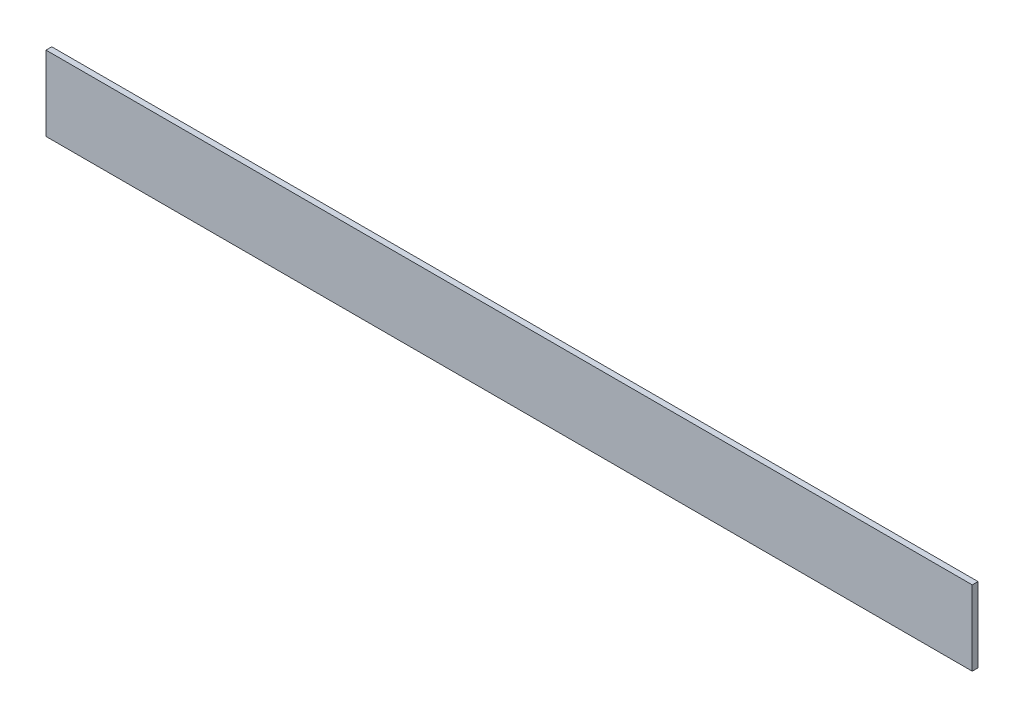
ISO-10303-21;
HEADER;
FILE_DESCRIPTION(('STEP AP214'),'2;1');
FILE_NAME('part.step','',(''),(''),'','','');
FILE_SCHEMA(('AUTOMOTIVE_DESIGN { 1 0 10303 214 1 1 1 1 }'));
ENDSEC;
DATA;
#1=APPLICATION_CONTEXT('core data for automotive mechanical design processes');
#2=APPLICATION_PROTOCOL_DEFINITION('international standard','automotive_design',2000,#1);
#3=PRODUCT_CONTEXT('',#1,'mechanical');
#4=PRODUCT('Part','Part','',(#3));
#5=PRODUCT_RELATED_PRODUCT_CATEGORY('part','',(#4));
#6=PRODUCT_DEFINITION_FORMATION('','',#4);
#7=PRODUCT_DEFINITION_CONTEXT('part definition',#1,'design');
#8=PRODUCT_DEFINITION('design','',#6,#7);
#9=PRODUCT_DEFINITION_SHAPE('','',#8);
#10=(LENGTH_UNIT() NAMED_UNIT(*) SI_UNIT(.MILLI.,.METRE.));
#11=(NAMED_UNIT(*) PLANE_ANGLE_UNIT() SI_UNIT($,.RADIAN.));
#12=(NAMED_UNIT(*) SI_UNIT($,.STERADIAN.) SOLID_ANGLE_UNIT());
#13=UNCERTAINTY_MEASURE_WITH_UNIT(LENGTH_MEASURE(1.E-05),#10,'distance_accuracy_value','');
#14=(GEOMETRIC_REPRESENTATION_CONTEXT(3) GLOBAL_UNCERTAINTY_ASSIGNED_CONTEXT((#13)) GLOBAL_UNIT_ASSIGNED_CONTEXT((#10,
#11,#12)) REPRESENTATION_CONTEXT('',''));
#15=CARTESIAN_POINT('',(0.,0.,0.));
#16=DIRECTION('',(0.,0.,1.));
#17=DIRECTION('',(1.,0.,0.));
#18=AXIS2_PLACEMENT_3D('',#15,#16,#17);
#19=CARTESIAN_POINT('',(0.,0.,1.));
#20=DIRECTION('',(1.,0.,0.));
#21=DIRECTION('',(0.,0.,-1.));
#22=AXIS2_PLACEMENT_3D('',#19,#20,#21);
#23=PLANE('',#22);
#24=DIRECTION('',(0.,-1.,0.));
#25=VECTOR('',#24,1.);
#26=CARTESIAN_POINT('',(0.,0.,0.));
#27=LINE('',#26,#25);
#28=CARTESIAN_POINT('',(0.,13.,0.));
#29=VERTEX_POINT('',#28);
#30=CARTESIAN_POINT('',(0.,0.,0.));
#31=VERTEX_POINT('',#30);
#32=EDGE_CURVE('E93',#29,#31,#27,.T.);
#33=ORIENTED_EDGE('',*,*,#32,.T.);
#34=DIRECTION('',(0.,0.,-1.));
#35=VECTOR('',#34,1.);
#36=CARTESIAN_POINT('',(0.,0.,1.));
#37=LINE('',#36,#35);
#38=CARTESIAN_POINT('',(0.,0.,1.));
#39=VERTEX_POINT('',#38);
#40=EDGE_CURVE('E11',#39,#31,#37,.T.);
#41=ORIENTED_EDGE('',*,*,#40,.F.);
#42=DIRECTION('',(0.,-1.,0.));
#43=VECTOR('',#42,1.);
#44=CARTESIAN_POINT('',(0.,0.,1.));
#45=LINE('',#44,#43);
#46=CARTESIAN_POINT('',(0.,13.,1.));
#47=VERTEX_POINT('',#46);
#48=EDGE_CURVE('E81',#47,#39,#45,.T.);
#49=ORIENTED_EDGE('',*,*,#48,.F.);
#50=DIRECTION('',(0.,0.,-1.));
#51=VECTOR('',#50,1.);
#52=CARTESIAN_POINT('',(0.,13.,1.));
#53=LINE('',#52,#51);
#54=EDGE_CURVE('E89',#47,#29,#53,.T.);
#55=ORIENTED_EDGE('',*,*,#54,.T.);
#56=EDGE_LOOP('',(#33,#41,#49,#55));
#57=FACE_BOUND('',#56,.T.);
#58=ADVANCED_FACE('F30',(#57),#23,.F.);
#59=CARTESIAN_POINT('',(0.,0.,1.));
#60=DIRECTION('',(0.,1.,0.));
#61=DIRECTION('',(0.,0.,1.));
#62=AXIS2_PLACEMENT_3D('',#59,#60,#61);
#63=PLANE('',#62);
#64=DIRECTION('',(1.,0.,0.));
#65=VECTOR('',#64,1.);
#66=CARTESIAN_POINT('',(0.,0.,0.));
#67=LINE('',#66,#65);
#68=CARTESIAN_POINT('',(161.,0.,0.));
#69=VERTEX_POINT('',#68);
#70=EDGE_CURVE('E85',#31,#69,#67,.T.);
#71=ORIENTED_EDGE('',*,*,#70,.T.);
#72=DIRECTION('',(0.,0.,-1.));
#73=VECTOR('',#72,1.);
#74=CARTESIAN_POINT('',(161.,0.,1.));
#75=LINE('',#74,#73);
#76=CARTESIAN_POINT('',(161.,0.,1.));
#77=VERTEX_POINT('',#76);
#78=EDGE_CURVE('E38',#77,#69,#75,.T.);
#79=ORIENTED_EDGE('',*,*,#78,.F.);
#80=DIRECTION('',(1.,0.,0.));
#81=VECTOR('',#80,1.);
#82=CARTESIAN_POINT('',(0.,0.,1.));
#83=LINE('',#82,#81);
#84=EDGE_CURVE('E76',#39,#77,#83,.T.);
#85=ORIENTED_EDGE('',*,*,#84,.F.);
#86=ORIENTED_EDGE('',*,*,#40,.T.);
#87=EDGE_LOOP('',(#71,#79,#85,#86));
#88=FACE_BOUND('',#87,.T.);
#89=ADVANCED_FACE('F84',(#88),#63,.F.);
#90=CARTESIAN_POINT('',(161.,0.,1.));
#91=DIRECTION('',(-1.,0.,0.));
#92=DIRECTION('',(0.,0.,1.));
#93=AXIS2_PLACEMENT_3D('',#90,#91,#92);
#94=PLANE('',#93);
#95=DIRECTION('',(0.,1.,0.));
#96=VECTOR('',#95,1.);
#97=CARTESIAN_POINT('',(161.,0.,0.));
#98=LINE('',#97,#96);
#99=CARTESIAN_POINT('',(161.,13.,0.));
#100=VERTEX_POINT('',#99);
#101=EDGE_CURVE('E63',#69,#100,#98,.T.);
#102=ORIENTED_EDGE('',*,*,#101,.T.);
#103=DIRECTION('',(0.,0.,-1.));
#104=VECTOR('',#103,1.);
#105=CARTESIAN_POINT('',(161.,13.,1.));
#106=LINE('',#105,#104);
#107=CARTESIAN_POINT('',(161.,13.,1.));
#108=VERTEX_POINT('',#107);
#109=EDGE_CURVE('E86',#108,#100,#106,.T.);
#110=ORIENTED_EDGE('',*,*,#109,.F.);
#111=DIRECTION('',(0.,1.,0.));
#112=VECTOR('',#111,1.);
#113=CARTESIAN_POINT('',(161.,0.,1.));
#114=LINE('',#113,#112);
#115=EDGE_CURVE('E79',#77,#108,#114,.T.);
#116=ORIENTED_EDGE('',*,*,#115,.F.);
#117=ORIENTED_EDGE('',*,*,#78,.T.);
#118=EDGE_LOOP('',(#102,#110,#116,#117));
#119=FACE_BOUND('',#118,.T.);
#120=ADVANCED_FACE('F87',(#119),#94,.F.);
#121=CARTESIAN_POINT('',(0.,13.,1.));
#122=DIRECTION('',(0.,-1.,0.));
#123=DIRECTION('',(0.,0.,-1.));
#124=AXIS2_PLACEMENT_3D('',#121,#122,#123);
#125=PLANE('',#124);
#126=DIRECTION('',(-1.,0.,0.));
#127=VECTOR('',#126,1.);
#128=CARTESIAN_POINT('',(0.,13.,0.));
#129=LINE('',#128,#127);
#130=EDGE_CURVE('E69',#100,#29,#129,.T.);
#131=ORIENTED_EDGE('',*,*,#130,.T.);
#132=ORIENTED_EDGE('',*,*,#54,.F.);
#133=DIRECTION('',(-1.,0.,0.));
#134=VECTOR('',#133,1.);
#135=CARTESIAN_POINT('',(0.,13.,1.));
#136=LINE('',#135,#134);
#137=EDGE_CURVE('E46',#108,#47,#136,.T.);
#138=ORIENTED_EDGE('',*,*,#137,.F.);
#139=ORIENTED_EDGE('',*,*,#109,.T.);
#140=EDGE_LOOP('',(#131,#132,#138,#139));
#141=FACE_BOUND('',#140,.T.);
#142=ADVANCED_FACE('F100',(#141),#125,.F.);
#143=CARTESIAN_POINT('',(0.,13.,1.));
#144=DIRECTION('',(0.,0.,-1.));
#145=DIRECTION('',(-1.,0.,0.));
#146=AXIS2_PLACEMENT_3D('',#143,#144,#145);
#147=PLANE('',#146);
#148=ORIENTED_EDGE('',*,*,#48,.T.);
#149=ORIENTED_EDGE('',*,*,#84,.T.);
#150=ORIENTED_EDGE('',*,*,#115,.T.);
#151=ORIENTED_EDGE('',*,*,#137,.T.);
#152=EDGE_LOOP('',(#148,#149,#150,#151));
#153=FACE_BOUND('',#152,.T.);
#154=ADVANCED_FACE('F77',(#153),#147,.F.);
#155=CARTESIAN_POINT('',(0.,13.,0.));
#156=DIRECTION('',(0.,0.,-1.));
#157=DIRECTION('',(-1.,0.,0.));
#158=AXIS2_PLACEMENT_3D('',#155,#156,#157);
#159=PLANE('',#158);
#160=ORIENTED_EDGE('',*,*,#32,.F.);
#161=ORIENTED_EDGE('',*,*,#130,.F.);
#162=ORIENTED_EDGE('',*,*,#101,.F.);
#163=ORIENTED_EDGE('',*,*,#70,.F.);
#164=EDGE_LOOP('',(#160,#161,#162,#163));
#165=FACE_BOUND('',#164,.T.);
#166=ADVANCED_FACE('F103',(#165),#159,.T.);
#167=CLOSED_SHELL('',(#58,#89,#120,#142,#154,#166));
#168=MANIFOLD_SOLID_BREP('B2',#167);
#169=ADVANCED_BREP_SHAPE_REPRESENTATION('',(#18,#168),#14);
#170=SHAPE_DEFINITION_REPRESENTATION(#9,#169);
ENDSEC;
END-ISO-10303-21;
